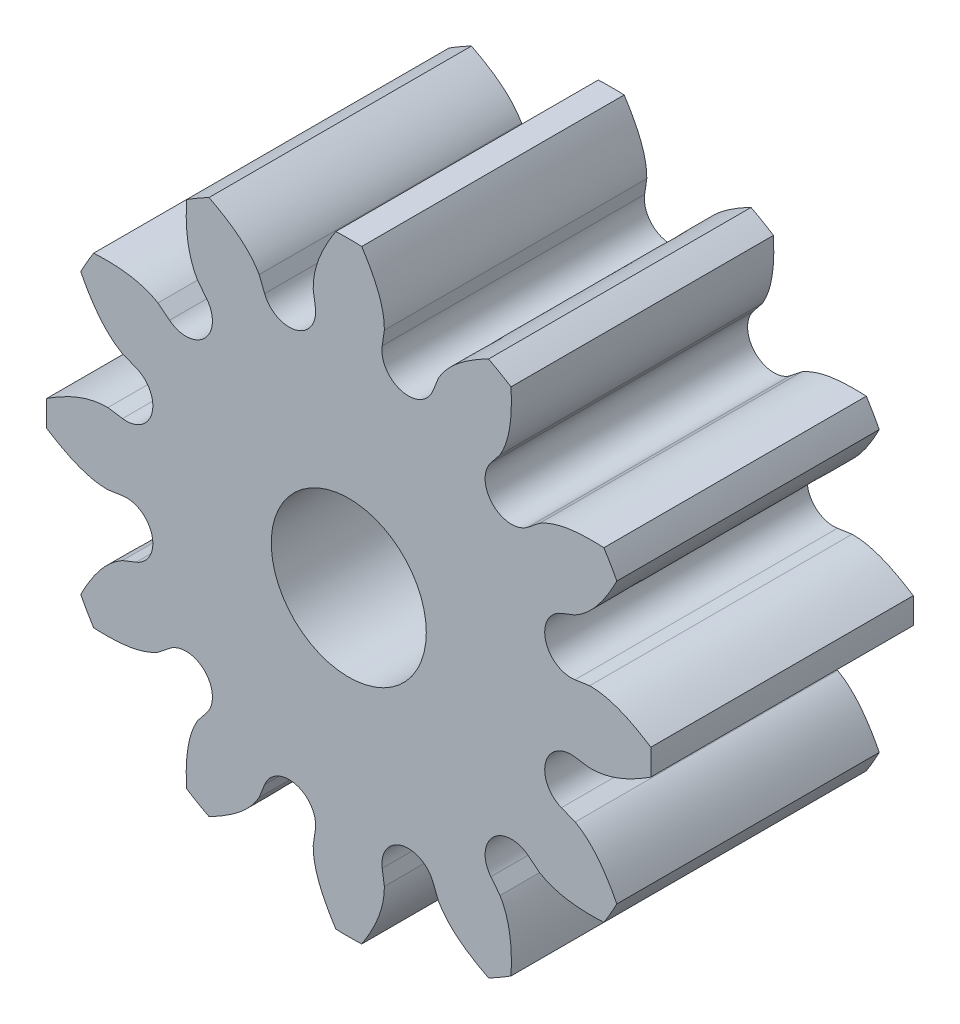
from build123d import *

# Parameters (mm, degrees)
SKETCH3_R                           = 2.3368
SKETCH3_R_2                         = 0.889
BASE_DEPTH                          = 3.0099
HALF_TOOTH_DEPTH                    = 3.0099
PATTERN_OF_HALF_TOOTH_COUNT         = 12
PATTERN_OF_HALF_TOOTH_COPY_1_DEPTH  = 3.0099
PATTERN_OF_HALF_TOOTH_COPY_2_DEPTH  = 3.0099
PATTERN_OF_HALF_TOOTH_COPY_3_DEPTH  = 3.0099
PATTERN_OF_HALF_TOOTH_COPY_4_DEPTH  = 3.0099
PATTERN_OF_HALF_TOOTH_COPY_5_DEPTH  = 3.0099
PATTERN_OF_HALF_TOOTH_COPY_6_DEPTH  = 3.0099
PATTERN_OF_HALF_TOOTH_COPY_7_DEPTH  = 3.0099
PATTERN_OF_HALF_TOOTH_COPY_8_DEPTH  = 3.0099
PATTERN_OF_HALF_TOOTH_COPY_9_DEPTH  = 3.0099
PATTERN_OF_HALF_TOOTH_COPY_10_DEPTH = 3.0099
PATTERN_OF_HALF_TOOTH_COPY_11_DEPTH = 3.0099


with BuildPart() as part:
    # Sketch3 → Base (new body)
    with BuildSketch(Plane.XY):
        Circle(SKETCH3_R)
        Circle(SKETCH3_R_2, mode=Mode.SUBTRACT)
    extrude(amount=BASE_DEPTH)

    # Sketch2 → Half tooth (add)
    with BuildSketch(Plane.XY):
        with BuildLine():
            Line((0, 3.4671), (0, 2.3368))
            ThreePointArc((0, 2.3368), (0.305013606, 2.316808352), (0.604808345, 2.257175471))
            ThreePointArc((0.604808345, 2.257175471), (0.429829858, 2.383610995), (0.383300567, 2.59441526))
            Line((0.383300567, 2.59441526), (0.408147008, 2.762591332))
            add(Edge.make_bspline(
                [(0.408147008, 2.762591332), (0.409130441, 2.824482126), (0.377383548, 3.076644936), (0.250049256, 3.305587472), (0.148558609, 3.463915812)],
                knots=[0, 0, 0, 0, 0.24444769, 1, 1, 1, 1], degree=3))
            ThreePointArc((0.148558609, 3.463915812), (0.074296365, 3.466303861), (0, 3.4671))
        make_face()
    half_tooth = extrude(amount=HALF_TOOTH_DEPTH)

    # Mirror of half tooth: Half tooth across plane
    add(half_tooth.mirror(Plane.ZY))

    # Pattern of half tooth: Half tooth ×12 about axis
    pattern_of_half_tooth_axis = Axis((0, 0, 0), (0, 0, -1))
    for i in range(1, PATTERN_OF_HALF_TOOTH_COUNT):
        add(half_tooth.rotate(pattern_of_half_tooth_axis, i * 360 / PATTERN_OF_HALF_TOOTH_COUNT))

    # Pattern of half tooth copy 1 sketch → Pattern of half tooth copy 1 (add)
    with BuildSketch(Plane(origin=(0, 0, 0), x_dir=(-0.8660254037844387, 0.49999999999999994, 0), z_dir=(0, 0, 1))):
        with BuildLine():
            Line((0, -3.4671), (0, -2.3368))
            ThreePointArc((0, -2.3368), (0.305013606, -2.316808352), (0.604808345, -2.257175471))
            ThreePointArc((0.604808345, -2.257175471), (0.429829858, -2.383610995), (0.383300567, -2.59441526))
            Line((0.383300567, -2.59441526), (0.408147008, -2.762591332))
            add(Edge.make_bspline(
                [(0.408147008, -2.762591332), (0.409130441, -2.824482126), (0.377383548, -3.076644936), (0.250049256, -3.305587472), (0.148558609, -3.463915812)],
                knots=[0, 0, 0, 0, 0.24444769, 1, 1, 1, 1], degree=3))
            ThreePointArc((0.148558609, -3.463915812), (0.074296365, -3.466303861), (0, -3.4671))
        make_face()
    extrude(amount=PATTERN_OF_HALF_TOOTH_COPY_1_DEPTH)

    # Pattern of half tooth copy 2 sketch → Pattern of half tooth copy 2 (add)
    with BuildSketch(Plane(origin=(0, 0, 0), x_dir=(-0.5000000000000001, 0.8660254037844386, 0), z_dir=(0, 0, 1))):
        with BuildLine():
            Line((0, -3.4671), (0, -2.3368))
            ThreePointArc((0, -2.3368), (0.305013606, -2.316808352), (0.604808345, -2.257175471))
            ThreePointArc((0.604808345, -2.257175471), (0.429829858, -2.383610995), (0.383300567, -2.59441526))
            Line((0.383300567, -2.59441526), (0.408147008, -2.762591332))
            add(Edge.make_bspline(
                [(0.408147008, -2.762591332), (0.409130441, -2.824482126), (0.377383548, -3.076644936), (0.250049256, -3.305587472), (0.148558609, -3.463915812)],
                knots=[0, 0, 0, 0, 0.24444769, 1, 1, 1, 1], degree=3))
            ThreePointArc((0.148558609, -3.463915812), (0.074296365, -3.466303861), (0, -3.4671))
        make_face()
    extrude(amount=PATTERN_OF_HALF_TOOTH_COPY_2_DEPTH)

    # Pattern of half tooth copy 3 sketch → Pattern of half tooth copy 3 (add)
    with BuildSketch(Plane(origin=(0, 0, 0), x_dir=(0, 1, 0), z_dir=(0, 0, 1))):
        with BuildLine():
            Line((0, -3.4671), (0, -2.3368))
            ThreePointArc((0, -2.3368), (0.305013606, -2.316808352), (0.604808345, -2.257175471))
            ThreePointArc((0.604808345, -2.257175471), (0.429829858, -2.383610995), (0.383300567, -2.59441526))
            Line((0.383300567, -2.59441526), (0.408147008, -2.762591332))
            add(Edge.make_bspline(
                [(0.408147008, -2.762591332), (0.409130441, -2.824482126), (0.377383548, -3.076644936), (0.250049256, -3.305587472), (0.148558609, -3.463915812)],
                knots=[0, 0, 0, 0, 0.24444769, 1, 1, 1, 1], degree=3))
            ThreePointArc((0.148558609, -3.463915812), (0.074296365, -3.466303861), (0, -3.4671))
        make_face()
    extrude(amount=PATTERN_OF_HALF_TOOTH_COPY_3_DEPTH)

    # Pattern of half tooth copy 4 sketch → Pattern of half tooth copy 4 (add)
    with BuildSketch(Plane(origin=(0, 0, 0), x_dir=(0.4999999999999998, 0.8660254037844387, 0), z_dir=(0, 0, 1))):
        with BuildLine():
            Line((0, -3.4671), (0, -2.3368))
            ThreePointArc((0, -2.3368), (0.305013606, -2.316808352), (0.604808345, -2.257175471))
            ThreePointArc((0.604808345, -2.257175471), (0.429829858, -2.383610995), (0.383300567, -2.59441526))
            Line((0.383300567, -2.59441526), (0.408147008, -2.762591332))
            add(Edge.make_bspline(
                [(0.408147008, -2.762591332), (0.409130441, -2.824482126), (0.377383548, -3.076644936), (0.250049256, -3.305587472), (0.148558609, -3.463915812)],
                knots=[0, 0, 0, 0, 0.24444769, 1, 1, 1, 1], degree=3))
            ThreePointArc((0.148558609, -3.463915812), (0.074296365, -3.466303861), (0, -3.4671))
        make_face()
    extrude(amount=PATTERN_OF_HALF_TOOTH_COPY_4_DEPTH)

    # Pattern of half tooth copy 5 sketch → Pattern of half tooth copy 5 (add)
    with BuildSketch(Plane(origin=(0, 0, 0), x_dir=(0.8660254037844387, 0.49999999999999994, 0), z_dir=(0, 0, 1))):
        with BuildLine():
            Line((0, -3.4671), (0, -2.3368))
            ThreePointArc((0, -2.3368), (0.305013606, -2.316808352), (0.604808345, -2.257175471))
            ThreePointArc((0.604808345, -2.257175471), (0.429829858, -2.383610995), (0.383300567, -2.59441526))
            Line((0.383300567, -2.59441526), (0.408147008, -2.762591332))
            add(Edge.make_bspline(
                [(0.408147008, -2.762591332), (0.409130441, -2.824482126), (0.377383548, -3.076644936), (0.250049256, -3.305587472), (0.148558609, -3.463915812)],
                knots=[0, 0, 0, 0, 0.24444769, 1, 1, 1, 1], degree=3))
            ThreePointArc((0.148558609, -3.463915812), (0.074296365, -3.466303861), (0, -3.4671))
        make_face()
    extrude(amount=PATTERN_OF_HALF_TOOTH_COPY_5_DEPTH)

    # Pattern of half tooth copy 6 sketch → Pattern of half tooth copy 6 (add)
    with BuildSketch(Plane.XY):
        with BuildLine():
            Line((0, -3.4671), (0, -2.3368))
            ThreePointArc((0, -2.3368), (0.305013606, -2.316808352), (0.604808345, -2.257175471))
            ThreePointArc((0.604808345, -2.257175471), (0.429829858, -2.383610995), (0.383300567, -2.59441526))
            Line((0.383300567, -2.59441526), (0.408147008, -2.762591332))
            add(Edge.make_bspline(
                [(0.408147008, -2.762591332), (0.409130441, -2.824482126), (0.377383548, -3.076644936), (0.250049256, -3.305587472), (0.148558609, -3.463915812)],
                knots=[0, 0, 0, 0, 0.24444769, 1, 1, 1, 1], degree=3))
            ThreePointArc((0.148558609, -3.463915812), (0.074296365, -3.466303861), (0, -3.4671))
        make_face()
    extrude(amount=PATTERN_OF_HALF_TOOTH_COPY_6_DEPTH)

    # Pattern of half tooth copy 7 sketch → Pattern of half tooth copy 7 (add)
    with BuildSketch(Plane(origin=(0, 0, 0), x_dir=(0.8660254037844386, -0.5000000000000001, 0), z_dir=(0, 0, 1))):
        with BuildLine():
            Line((0, -3.4671), (0, -2.3368))
            ThreePointArc((0, -2.3368), (0.305013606, -2.316808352), (0.604808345, -2.257175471))
            ThreePointArc((0.604808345, -2.257175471), (0.429829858, -2.383610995), (0.383300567, -2.59441526))
            Line((0.383300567, -2.59441526), (0.408147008, -2.762591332))
            add(Edge.make_bspline(
                [(0.408147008, -2.762591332), (0.409130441, -2.824482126), (0.377383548, -3.076644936), (0.250049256, -3.305587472), (0.148558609, -3.463915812)],
                knots=[0, 0, 0, 0, 0.24444769, 1, 1, 1, 1], degree=3))
            ThreePointArc((0.148558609, -3.463915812), (0.074296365, -3.466303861), (0, -3.4671))
        make_face()
    extrude(amount=PATTERN_OF_HALF_TOOTH_COPY_7_DEPTH)

    # Pattern of half tooth copy 8 sketch → Pattern of half tooth copy 8 (add)
    with BuildSketch(Plane(origin=(0, 0, 0), x_dir=(0.5000000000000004, -0.8660254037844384, 0), z_dir=(0, 0, 1))):
        with BuildLine():
            Line((0, -3.4671), (0, -2.3368))
            ThreePointArc((0, -2.3368), (0.305013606, -2.316808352), (0.604808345, -2.257175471))
            ThreePointArc((0.604808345, -2.257175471), (0.429829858, -2.383610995), (0.383300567, -2.59441526))
            Line((0.383300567, -2.59441526), (0.408147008, -2.762591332))
            add(Edge.make_bspline(
                [(0.408147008, -2.762591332), (0.409130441, -2.824482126), (0.377383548, -3.076644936), (0.250049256, -3.305587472), (0.148558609, -3.463915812)],
                knots=[0, 0, 0, 0, 0.24444769, 1, 1, 1, 1], degree=3))
            ThreePointArc((0.148558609, -3.463915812), (0.074296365, -3.466303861), (0, -3.4671))
        make_face()
    extrude(amount=PATTERN_OF_HALF_TOOTH_COPY_8_DEPTH)

    # Pattern of half tooth copy 9 sketch → Pattern of half tooth copy 9 (add)
    with BuildSketch(Plane(origin=(0, 0, 0), x_dir=(0, -1, 0), z_dir=(0, 0, 1))):
        with BuildLine():
            Line((0, -3.4671), (0, -2.3368))
            ThreePointArc((0, -2.3368), (0.305013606, -2.316808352), (0.604808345, -2.257175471))
            ThreePointArc((0.604808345, -2.257175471), (0.429829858, -2.383610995), (0.383300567, -2.59441526))
            Line((0.383300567, -2.59441526), (0.408147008, -2.762591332))
            add(Edge.make_bspline(
                [(0.408147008, -2.762591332), (0.409130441, -2.824482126), (0.377383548, -3.076644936), (0.250049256, -3.305587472), (0.148558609, -3.463915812)],
                knots=[0, 0, 0, 0, 0.24444769, 1, 1, 1, 1], degree=3))
            ThreePointArc((0.148558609, -3.463915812), (0.074296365, -3.466303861), (0, -3.4671))
        make_face()
    extrude(amount=PATTERN_OF_HALF_TOOTH_COPY_9_DEPTH)

    # Pattern of half tooth copy 10 sketch → Pattern of half tooth copy 10 (add)
    with BuildSketch(Plane(origin=(0, 0, 0), x_dir=(-0.5000000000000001, -0.8660254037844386, 0), z_dir=(0, 0, 1))):
        with BuildLine():
            Line((0, -3.4671), (0, -2.3368))
            ThreePointArc((0, -2.3368), (0.305013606, -2.316808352), (0.604808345, -2.257175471))
            ThreePointArc((0.604808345, -2.257175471), (0.429829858, -2.383610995), (0.383300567, -2.59441526))
            Line((0.383300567, -2.59441526), (0.408147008, -2.762591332))
            add(Edge.make_bspline(
                [(0.408147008, -2.762591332), (0.409130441, -2.824482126), (0.377383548, -3.076644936), (0.250049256, -3.305587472), (0.148558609, -3.463915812)],
                knots=[0, 0, 0, 0, 0.24444769, 1, 1, 1, 1], degree=3))
            ThreePointArc((0.148558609, -3.463915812), (0.074296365, -3.466303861), (0, -3.4671))
        make_face()
    extrude(amount=PATTERN_OF_HALF_TOOTH_COPY_10_DEPTH)

    # Pattern of half tooth copy 11 sketch → Pattern of half tooth copy 11 (add)
    with BuildSketch(Plane(origin=(0, 0, 0), x_dir=(-0.8660254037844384, -0.5000000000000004, 0), z_dir=(0, 0, 1))):
        with BuildLine():
            Line((0, -3.4671), (0, -2.3368))
            ThreePointArc((0, -2.3368), (0.305013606, -2.316808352), (0.604808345, -2.257175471))
            ThreePointArc((0.604808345, -2.257175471), (0.429829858, -2.383610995), (0.383300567, -2.59441526))
            Line((0.383300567, -2.59441526), (0.408147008, -2.762591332))
            add(Edge.make_bspline(
                [(0.408147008, -2.762591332), (0.409130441, -2.824482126), (0.377383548, -3.076644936), (0.250049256, -3.305587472), (0.148558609, -3.463915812)],
                knots=[0, 0, 0, 0, 0.24444769, 1, 1, 1, 1], degree=3))
            ThreePointArc((0.148558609, -3.463915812), (0.074296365, -3.466303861), (0, -3.4671))
        make_face()
    extrude(amount=PATTERN_OF_HALF_TOOTH_COPY_11_DEPTH)


solid = part.part
